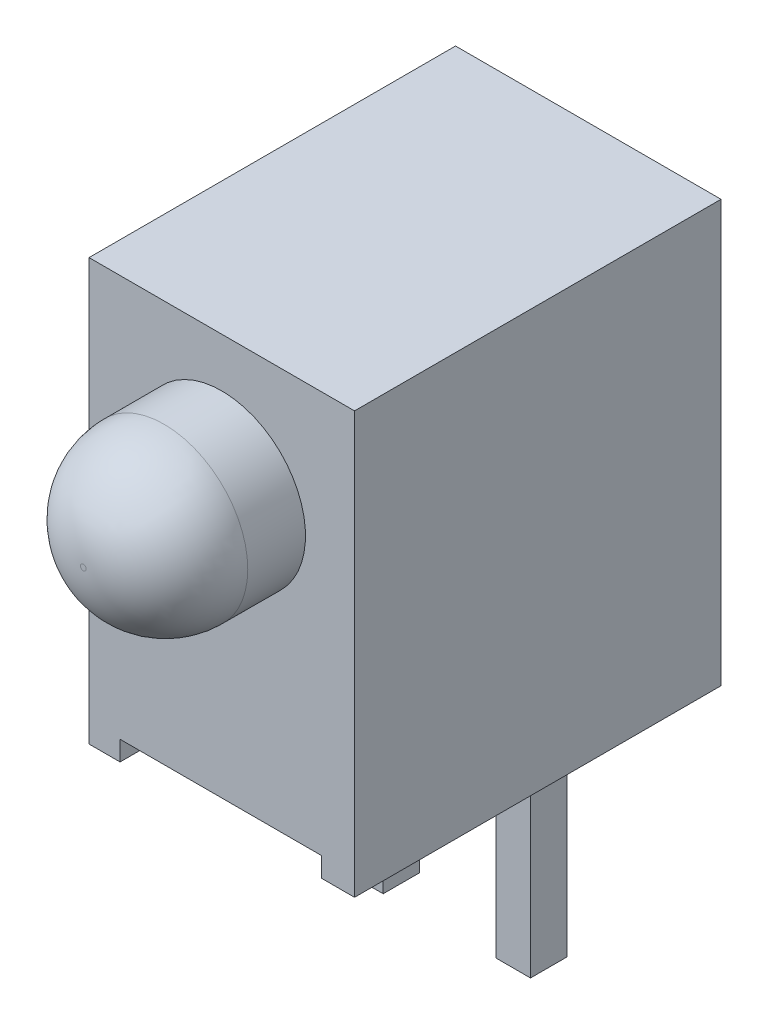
ISO-10303-21;
HEADER;
FILE_DESCRIPTION(('STEP AP214'),'2;1');
FILE_NAME('part.step','',(''),(''),'','','');
FILE_SCHEMA(('AUTOMOTIVE_DESIGN { 1 0 10303 214 1 1 1 1 }'));
ENDSEC;
DATA;
#1=APPLICATION_CONTEXT('core data for automotive mechanical design processes');
#2=APPLICATION_PROTOCOL_DEFINITION('international standard','automotive_design',2000,#1);
#3=PRODUCT_CONTEXT('',#1,'mechanical');
#4=PRODUCT('Part','Part','',(#3));
#5=PRODUCT_RELATED_PRODUCT_CATEGORY('part','',(#4));
#6=PRODUCT_DEFINITION_FORMATION('','',#4);
#7=PRODUCT_DEFINITION_CONTEXT('part definition',#1,'design');
#8=PRODUCT_DEFINITION('design','',#6,#7);
#9=PRODUCT_DEFINITION_SHAPE('','',#8);
#10=(LENGTH_UNIT() NAMED_UNIT(*) SI_UNIT(.MILLI.,.METRE.));
#11=(NAMED_UNIT(*) PLANE_ANGLE_UNIT() SI_UNIT($,.RADIAN.));
#12=(NAMED_UNIT(*) SI_UNIT($,.STERADIAN.) SOLID_ANGLE_UNIT());
#13=UNCERTAINTY_MEASURE_WITH_UNIT(LENGTH_MEASURE(1.E-05),#10,'distance_accuracy_value','');
#14=(GEOMETRIC_REPRESENTATION_CONTEXT(3) GLOBAL_UNCERTAINTY_ASSIGNED_CONTEXT((#13)) GLOBAL_UNIT_ASSIGNED_CONTEXT((#10,
#11,#12)) REPRESENTATION_CONTEXT('',''));
#15=CARTESIAN_POINT('',(0.,0.,0.));
#16=DIRECTION('',(0.,0.,1.));
#17=DIRECTION('',(1.,0.,0.));
#18=AXIS2_PLACEMENT_3D('',#15,#16,#17);
#19=CARTESIAN_POINT('',(-1.76265219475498,0.340679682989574,-3.175));
#20=DIRECTION('',(0.,1.,0.));
#21=DIRECTION('',(0.,0.,1.));
#22=AXIS2_PLACEMENT_3D('',#19,#20,#21);
#23=PLANE('',#22);
#24=DIRECTION('',(0.,0.,1.));
#25=VECTOR('',#24,1.);
#26=CARTESIAN_POINT('',(-0.974553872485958,0.340679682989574,-0.596020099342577));
#27=LINE('',#26,#25);
#28=CARTESIAN_POINT('',(-0.974553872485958,0.340679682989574,-1.22879915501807));
#29=VERTEX_POINT('',#28);
#30=CARTESIAN_POINT('',(-0.974553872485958,0.340679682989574,-0.596020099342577));
#31=VERTEX_POINT('',#30);
#32=EDGE_CURVE('E166',#29,#31,#27,.T.);
#33=ORIENTED_EDGE('',*,*,#32,.F.);
#34=DIRECTION('',(1.,0.,0.));
#35=VECTOR('',#34,1.);
#36=CARTESIAN_POINT('',(-1.57455387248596,0.340679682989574,-1.22879915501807));
#37=LINE('',#36,#35);
#38=CARTESIAN_POINT('',(-1.57455387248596,0.340679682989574,-1.22879915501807));
#39=VERTEX_POINT('',#38);
#40=EDGE_CURVE('E179',#39,#29,#37,.T.);
#41=ORIENTED_EDGE('',*,*,#40,.F.);
#42=DIRECTION('',(0.,0.,-1.));
#43=VECTOR('',#42,1.);
#44=CARTESIAN_POINT('',(-1.57455387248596,0.340679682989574,-0.596020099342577));
#45=LINE('',#44,#43);
#46=CARTESIAN_POINT('',(-1.57455387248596,0.340679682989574,-0.596020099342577));
#47=VERTEX_POINT('',#46);
#48=EDGE_CURVE('E188',#47,#39,#45,.T.);
#49=ORIENTED_EDGE('',*,*,#48,.F.);
#50=DIRECTION('',(-1.,0.,0.));
#51=VECTOR('',#50,1.);
#52=CARTESIAN_POINT('',(-1.57455387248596,0.340679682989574,-0.596020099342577));
#53=LINE('',#52,#51);
#54=EDGE_CURVE('E169',#31,#47,#53,.T.);
#55=ORIENTED_EDGE('',*,*,#54,.F.);
#56=EDGE_LOOP('',(#33,#41,#49,#55));
#57=FACE_BOUND('',#56,.T.);
#58=DIRECTION('',(-1.,0.,0.));
#59=VECTOR('',#58,1.);
#60=CARTESIAN_POINT('',(-1.76265219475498,0.340679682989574,3.175));
#61=LINE('',#60,#59);
#62=CARTESIAN_POINT('',(1.73117626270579,0.340679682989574,3.175));
#63=VERTEX_POINT('',#62);
#64=CARTESIAN_POINT('',(-1.76265219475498,0.340679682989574,3.175));
#65=VERTEX_POINT('',#64);
#66=EDGE_CURVE('E209',#63,#65,#61,.T.);
#67=ORIENTED_EDGE('',*,*,#66,.T.);
#68=DIRECTION('',(0.,0.,1.));
#69=VECTOR('',#68,1.);
#70=CARTESIAN_POINT('',(-1.76265219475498,0.340679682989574,-3.175));
#71=LINE('',#70,#69);
#72=CARTESIAN_POINT('',(-1.76265219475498,0.340679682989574,-3.175));
#73=VERTEX_POINT('',#72);
#74=EDGE_CURVE('E222',#73,#65,#71,.T.);
#75=ORIENTED_EDGE('',*,*,#74,.F.);
#76=DIRECTION('',(-1.,0.,0.));
#77=VECTOR('',#76,1.);
#78=CARTESIAN_POINT('',(-1.76265219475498,0.340679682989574,-3.175));
#79=LINE('',#78,#77);
#80=CARTESIAN_POINT('',(1.73117626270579,0.340679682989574,-3.175));
#81=VERTEX_POINT('',#80);
#82=EDGE_CURVE('E212',#81,#73,#79,.T.);
#83=ORIENTED_EDGE('',*,*,#82,.F.);
#84=DIRECTION('',(0.,0.,1.));
#85=VECTOR('',#84,1.);
#86=CARTESIAN_POINT('',(1.73117626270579,0.340679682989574,-3.175));
#87=LINE('',#86,#85);
#88=EDGE_CURVE('E225',#81,#63,#87,.T.);
#89=ORIENTED_EDGE('',*,*,#88,.T.);
#90=EDGE_LOOP('',(#67,#75,#83,#89));
#91=FACE_BOUND('',#90,.T.);
#92=DIRECTION('',(0.,0.,1.));
#93=VECTOR('',#92,1.);
#94=CARTESIAN_POINT('',(1.56544612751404,0.340679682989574,-0.608610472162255));
#95=LINE('',#94,#93);
#96=CARTESIAN_POINT('',(1.56544612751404,0.340679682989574,-1.24138952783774));
#97=VERTEX_POINT('',#96);
#98=CARTESIAN_POINT('',(1.56544612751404,0.340679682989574,-0.608610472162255));
#99=VERTEX_POINT('',#98);
#100=EDGE_CURVE('E165',#97,#99,#95,.T.);
#101=ORIENTED_EDGE('',*,*,#100,.F.);
#102=DIRECTION('',(1.,0.,0.));
#103=VECTOR('',#102,1.);
#104=CARTESIAN_POINT('',(0.965446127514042,0.340679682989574,-1.24138952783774));
#105=LINE('',#104,#103);
#106=CARTESIAN_POINT('',(0.965446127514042,0.340679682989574,-1.24138952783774));
#107=VERTEX_POINT('',#106);
#108=EDGE_CURVE('E162',#107,#97,#105,.T.);
#109=ORIENTED_EDGE('',*,*,#108,.F.);
#110=DIRECTION('',(0.,0.,-1.));
#111=VECTOR('',#110,1.);
#112=CARTESIAN_POINT('',(0.965446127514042,0.340679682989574,-0.608610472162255));
#113=LINE('',#112,#111);
#114=CARTESIAN_POINT('',(0.965446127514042,0.340679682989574,-0.608610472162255));
#115=VERTEX_POINT('',#114);
#116=EDGE_CURVE('E52',#115,#107,#113,.T.);
#117=ORIENTED_EDGE('',*,*,#116,.F.);
#118=DIRECTION('',(-1.,0.,0.));
#119=VECTOR('',#118,1.);
#120=CARTESIAN_POINT('',(0.965446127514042,0.340679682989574,-0.608610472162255));
#121=LINE('',#120,#119);
#122=EDGE_CURVE('E47',#99,#115,#121,.T.);
#123=ORIENTED_EDGE('',*,*,#122,.F.);
#124=EDGE_LOOP('',(#101,#109,#117,#123));
#125=FACE_BOUND('',#124,.T.);
#126=ADVANCED_FACE('F32',(#57,#91,#125),#23,.F.);
#127=CARTESIAN_POINT('',(2.3,0.,3.175));
#128=DIRECTION('',(0.,1.,0.));
#129=DIRECTION('',(0.,0.,1.));
#130=AXIS2_PLACEMENT_3D('',#127,#128,#129);
#131=PLANE('',#130);
#132=DIRECTION('',(-1.,0.,0.));
#133=VECTOR('',#132,1.);
#134=CARTESIAN_POINT('',(-2.3,0.,-3.175));
#135=LINE('',#134,#133);
#136=CARTESIAN_POINT('',(-1.76265219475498,0.,-3.175));
#137=VERTEX_POINT('',#136);
#138=CARTESIAN_POINT('',(-2.3,0.,-3.175));
#139=VERTEX_POINT('',#138);
#140=EDGE_CURVE('E244',#137,#139,#135,.T.);
#141=ORIENTED_EDGE('',*,*,#140,.F.);
#142=DIRECTION('',(0.,0.,1.));
#143=VECTOR('',#142,1.);
#144=CARTESIAN_POINT('',(-1.76265219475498,0.,-3.175));
#145=LINE('',#144,#143);
#146=CARTESIAN_POINT('',(-1.76265219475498,0.,3.175));
#147=VERTEX_POINT('',#146);
#148=EDGE_CURVE('E215',#137,#147,#145,.T.);
#149=ORIENTED_EDGE('',*,*,#148,.T.);
#150=DIRECTION('',(1.,0.,0.));
#151=VECTOR('',#150,1.);
#152=CARTESIAN_POINT('',(-2.3,0.,3.175));
#153=LINE('',#152,#151);
#154=CARTESIAN_POINT('',(-2.3,0.,3.175));
#155=VERTEX_POINT('',#154);
#156=EDGE_CURVE('E235',#155,#147,#153,.T.);
#157=ORIENTED_EDGE('',*,*,#156,.F.);
#158=DIRECTION('',(0.,0.,1.));
#159=VECTOR('',#158,1.);
#160=CARTESIAN_POINT('',(-2.3,0.,-3.175));
#161=LINE('',#160,#159);
#162=EDGE_CURVE('E248',#139,#155,#161,.T.);
#163=ORIENTED_EDGE('',*,*,#162,.F.);
#164=EDGE_LOOP('',(#141,#149,#157,#163));
#165=FACE_BOUND('',#164,.T.);
#166=ADVANCED_FACE('F285',(#165),#131,.F.);
#167=CARTESIAN_POINT('',(-2.3,7.3,3.175));
#168=DIRECTION('',(0.,0.,-1.));
#169=DIRECTION('',(-1.,0.,0.));
#170=AXIS2_PLACEMENT_3D('',#167,#168,#169);
#171=PLANE('',#170);
#172=ORIENTED_EDGE('',*,*,#156,.T.);
#173=DIRECTION('',(0.,-1.,0.));
#174=VECTOR('',#173,1.);
#175=CARTESIAN_POINT('',(-1.76265219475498,0.,3.175));
#176=LINE('',#175,#174);
#177=EDGE_CURVE('E204',#65,#147,#176,.T.);
#178=ORIENTED_EDGE('',*,*,#177,.F.);
#179=ORIENTED_EDGE('',*,*,#66,.F.);
#180=DIRECTION('',(0.,1.,0.));
#181=VECTOR('',#180,1.);
#182=CARTESIAN_POINT('',(1.73117626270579,0.,3.175));
#183=LINE('',#182,#181);
#184=CARTESIAN_POINT('',(1.73117626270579,0.,3.175));
#185=VERTEX_POINT('',#184);
#186=EDGE_CURVE('E217',#185,#63,#183,.T.);
#187=ORIENTED_EDGE('',*,*,#186,.F.);
#188=CARTESIAN_POINT('',(2.3,0.,3.175));
#189=VERTEX_POINT('',#188);
#190=EDGE_CURVE('E250',#185,#189,#153,.T.);
#191=ORIENTED_EDGE('',*,*,#190,.T.);
#192=DIRECTION('',(0.,-1.,0.));
#193=VECTOR('',#192,1.);
#194=CARTESIAN_POINT('',(2.3,7.3,3.175));
#195=LINE('',#194,#193);
#196=CARTESIAN_POINT('',(2.3,7.3,3.175));
#197=VERTEX_POINT('',#196);
#198=EDGE_CURVE('E241',#197,#189,#195,.T.);
#199=ORIENTED_EDGE('',*,*,#198,.F.);
#200=DIRECTION('',(1.,0.,0.));
#201=VECTOR('',#200,1.);
#202=CARTESIAN_POINT('',(-2.3,7.3,3.175));
#203=LINE('',#202,#201);
#204=CARTESIAN_POINT('',(-2.3,7.3,3.175));
#205=VERTEX_POINT('',#204);
#206=EDGE_CURVE('E239',#205,#197,#203,.T.);
#207=ORIENTED_EDGE('',*,*,#206,.F.);
#208=DIRECTION('',(0.,-1.,0.));
#209=VECTOR('',#208,1.);
#210=CARTESIAN_POINT('',(-2.3,7.3,3.175));
#211=LINE('',#210,#209);
#212=EDGE_CURVE('E255',#205,#155,#211,.T.);
#213=ORIENTED_EDGE('',*,*,#212,.T.);
#214=EDGE_LOOP('',(#172,#178,#179,#187,#191,#199,#207,#213));
#215=FACE_BOUND('',#214,.T.);
#216=CARTESIAN_POINT('',(0.,5.,3.175));
#217=DIRECTION('',(0.,0.,-1.));
#218=DIRECTION('',(-1.,0.,0.));
#219=AXIS2_PLACEMENT_3D('',#216,#217,#218);
#220=CIRCLE('',#219,1.45);
#221=CARTESIAN_POINT('',(-1.45,5.,3.175));
#222=VERTEX_POINT('',#221);
#223=EDGE_CURVE('E264',#222,#222,#220,.F.);
#224=ORIENTED_EDGE('',*,*,#223,.F.);
#225=EDGE_LOOP('',(#224));
#226=FACE_BOUND('',#225,.T.);
#227=ADVANCED_FACE('F291',(#215,#226),#171,.F.);
#228=CARTESIAN_POINT('',(2.3,7.3,-3.175));
#229=DIRECTION('',(-1.,0.,0.));
#230=DIRECTION('',(0.,0.,1.));
#231=AXIS2_PLACEMENT_3D('',#228,#229,#230);
#232=PLANE('',#231);
#233=DIRECTION('',(0.,0.,-1.));
#234=VECTOR('',#233,1.);
#235=CARTESIAN_POINT('',(2.3,0.,-3.175));
#236=LINE('',#235,#234);
#237=CARTESIAN_POINT('',(2.3,0.,-3.175));
#238=VERTEX_POINT('',#237);
#239=EDGE_CURVE('E224',#189,#238,#236,.T.);
#240=ORIENTED_EDGE('',*,*,#239,.T.);
#241=DIRECTION('',(0.,-1.,0.));
#242=VECTOR('',#241,1.);
#243=CARTESIAN_POINT('',(2.3,7.3,-3.175));
#244=LINE('',#243,#242);
#245=CARTESIAN_POINT('',(2.3,7.3,-3.175));
#246=VERTEX_POINT('',#245);
#247=EDGE_CURVE('E261',#246,#238,#244,.T.);
#248=ORIENTED_EDGE('',*,*,#247,.F.);
#249=DIRECTION('',(0.,0.,-1.));
#250=VECTOR('',#249,1.);
#251=CARTESIAN_POINT('',(2.3,7.3,-3.175));
#252=LINE('',#251,#250);
#253=EDGE_CURVE('E231',#197,#246,#252,.T.);
#254=ORIENTED_EDGE('',*,*,#253,.F.);
#255=ORIENTED_EDGE('',*,*,#198,.T.);
#256=EDGE_LOOP('',(#240,#248,#254,#255));
#257=FACE_BOUND('',#256,.T.);
#258=ADVANCED_FACE('F315',(#257),#232,.F.);
#259=CARTESIAN_POINT('',(-2.3,7.3,-3.175));
#260=DIRECTION('',(0.,0.,1.));
#261=DIRECTION('',(1.,0.,0.));
#262=AXIS2_PLACEMENT_3D('',#259,#260,#261);
#263=PLANE('',#262);
#264=ORIENTED_EDGE('',*,*,#82,.T.);
#265=DIRECTION('',(0.,-1.,0.));
#266=VECTOR('',#265,1.);
#267=CARTESIAN_POINT('',(-1.76265219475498,0.,-3.175));
#268=LINE('',#267,#266);
#269=EDGE_CURVE('E205',#73,#137,#268,.T.);
#270=ORIENTED_EDGE('',*,*,#269,.T.);
#271=ORIENTED_EDGE('',*,*,#140,.T.);
#272=DIRECTION('',(0.,-1.,0.));
#273=VECTOR('',#272,1.);
#274=CARTESIAN_POINT('',(-2.3,7.3,-3.175));
#275=LINE('',#274,#273);
#276=CARTESIAN_POINT('',(-2.3,7.3,-3.175));
#277=VERTEX_POINT('',#276);
#278=EDGE_CURVE('E258',#277,#139,#275,.T.);
#279=ORIENTED_EDGE('',*,*,#278,.F.);
#280=DIRECTION('',(-1.,0.,0.));
#281=VECTOR('',#280,1.);
#282=CARTESIAN_POINT('',(-2.3,7.3,-3.175));
#283=LINE('',#282,#281);
#284=EDGE_CURVE('E234',#246,#277,#283,.T.);
#285=ORIENTED_EDGE('',*,*,#284,.F.);
#286=ORIENTED_EDGE('',*,*,#247,.T.);
#287=CARTESIAN_POINT('',(1.73117626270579,0.,-3.175));
#288=VERTEX_POINT('',#287);
#289=EDGE_CURVE('E245',#238,#288,#135,.T.);
#290=ORIENTED_EDGE('',*,*,#289,.T.);
#291=DIRECTION('',(0.,1.,0.));
#292=VECTOR('',#291,1.);
#293=CARTESIAN_POINT('',(1.73117626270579,0.,-3.175));
#294=LINE('',#293,#292);
#295=EDGE_CURVE('E208',#288,#81,#294,.T.);
#296=ORIENTED_EDGE('',*,*,#295,.T.);
#297=EDGE_LOOP('',(#264,#270,#271,#279,#285,#286,#290,#296));
#298=FACE_BOUND('',#297,.T.);
#299=ADVANCED_FACE('F319',(#298),#263,.F.);
#300=CARTESIAN_POINT('',(-2.3,7.3,-3.175));
#301=DIRECTION('',(1.,0.,0.));
#302=DIRECTION('',(0.,0.,-1.));
#303=AXIS2_PLACEMENT_3D('',#300,#301,#302);
#304=PLANE('',#303);
#305=ORIENTED_EDGE('',*,*,#162,.T.);
#306=ORIENTED_EDGE('',*,*,#212,.F.);
#307=DIRECTION('',(0.,0.,1.));
#308=VECTOR('',#307,1.);
#309=CARTESIAN_POINT('',(-2.3,7.3,-3.175));
#310=LINE('',#309,#308);
#311=EDGE_CURVE('E237',#277,#205,#310,.T.);
#312=ORIENTED_EDGE('',*,*,#311,.F.);
#313=ORIENTED_EDGE('',*,*,#278,.T.);
#314=EDGE_LOOP('',(#305,#306,#312,#313));
#315=FACE_BOUND('',#314,.T.);
#316=ADVANCED_FACE('F308',(#315),#304,.F.);
#317=CARTESIAN_POINT('',(2.3,7.3,3.175));
#318=DIRECTION('',(0.,1.,0.));
#319=DIRECTION('',(0.,0.,1.));
#320=AXIS2_PLACEMENT_3D('',#317,#318,#319);
#321=PLANE('',#320);
#322=ORIENTED_EDGE('',*,*,#253,.T.);
#323=ORIENTED_EDGE('',*,*,#284,.T.);
#324=ORIENTED_EDGE('',*,*,#311,.T.);
#325=ORIENTED_EDGE('',*,*,#206,.T.);
#326=EDGE_LOOP('',(#322,#323,#324,#325));
#327=FACE_BOUND('',#326,.T.);
#328=ADVANCED_FACE('F306',(#327),#321,.T.);
#329=ORIENTED_EDGE('',*,*,#190,.F.);
#330=DIRECTION('',(0.,0.,1.));
#331=VECTOR('',#330,1.);
#332=CARTESIAN_POINT('',(1.73117626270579,0.,-3.175));
#333=LINE('',#332,#331);
#334=EDGE_CURVE('E227',#288,#185,#333,.T.);
#335=ORIENTED_EDGE('',*,*,#334,.F.);
#336=ORIENTED_EDGE('',*,*,#289,.F.);
#337=ORIENTED_EDGE('',*,*,#239,.F.);
#338=EDGE_LOOP('',(#329,#335,#336,#337));
#339=FACE_BOUND('',#338,.T.);
#340=ADVANCED_FACE('F294',(#339),#131,.F.);
#341=CARTESIAN_POINT('',(0.,5.,5.575));
#342=DIRECTION('',(0.,0.,-1.));
#343=DIRECTION('',(-1.,0.,0.));
#344=AXIS2_PLACEMENT_3D('',#341,#342,#343);
#345=CYLINDRICAL_SURFACE('',#344,1.45);
#346=CARTESIAN_POINT('',(0.,5.,4.175));
#347=DIRECTION('',(0.,0.,1.));
#348=DIRECTION('',(1.,0.,0.));
#349=AXIS2_PLACEMENT_3D('',#346,#347,#348);
#350=CIRCLE('',#349,1.45);
#351=CARTESIAN_POINT('',(1.45,5.,4.175));
#352=VERTEX_POINT('',#351);
#353=EDGE_CURVE('E11',#352,#352,#350,.F.);
#354=ORIENTED_EDGE('',*,*,#353,.T.);
#355=EDGE_LOOP('',(#354));
#356=FACE_BOUND('',#355,.T.);
#357=ORIENTED_EDGE('',*,*,#223,.T.);
#358=EDGE_LOOP('',(#357));
#359=FACE_BOUND('',#358,.T.);
#360=ADVANCED_FACE('F281',(#356,#359),#345,.T.);
#361=CARTESIAN_POINT('',(0.,5.,5.575));
#362=DIRECTION('',(0.,0.,1.));
#363=DIRECTION('',(1.,0.,0.));
#364=AXIS2_PLACEMENT_3D('',#361,#362,#363);
#365=PLANE('',#364);
#366=CARTESIAN_POINT('',(0.,5.,5.575));
#367=DIRECTION('',(0.,0.,1.));
#368=DIRECTION('',(1.,0.,0.));
#369=AXIS2_PLACEMENT_3D('',#366,#367,#368);
#370=CIRCLE('',#369,0.0499999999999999);
#371=CARTESIAN_POINT('',(0.0499999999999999,5.,5.575));
#372=VERTEX_POINT('',#371);
#373=EDGE_CURVE('E40',#372,#372,#370,.T.);
#374=ORIENTED_EDGE('',*,*,#373,.T.);
#375=EDGE_LOOP('',(#374));
#376=FACE_BOUND('',#375,.T.);
#377=ADVANCED_FACE('F269',(#376),#365,.T.);
#378=CARTESIAN_POINT('',(0.,5.,4.175));
#379=DIRECTION('',(0.,0.,1.));
#380=DIRECTION('',(1.,0.,0.));
#381=AXIS2_PLACEMENT_3D('',#378,#379,#380);
#382=DEGENERATE_TOROIDAL_SURFACE('',#381,0.0499999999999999,1.4,.T.);
#383=ORIENTED_EDGE('',*,*,#353,.F.);
#384=EDGE_LOOP('',(#383));
#385=FACE_BOUND('',#384,.T.);
#386=ORIENTED_EDGE('',*,*,#373,.F.);
#387=EDGE_LOOP('',(#386));
#388=FACE_BOUND('',#387,.T.);
#389=ADVANCED_FACE('F34',(#385,#388),#382,.T.);
#390=CARTESIAN_POINT('',(-1.76265219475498,0.,-3.175));
#391=DIRECTION('',(-1.,0.,0.));
#392=DIRECTION('',(0.,0.,1.));
#393=AXIS2_PLACEMENT_3D('',#390,#391,#392);
#394=PLANE('',#393);
#395=ORIENTED_EDGE('',*,*,#177,.T.);
#396=ORIENTED_EDGE('',*,*,#148,.F.);
#397=ORIENTED_EDGE('',*,*,#269,.F.);
#398=ORIENTED_EDGE('',*,*,#74,.T.);
#399=EDGE_LOOP('',(#395,#396,#397,#398));
#400=FACE_BOUND('',#399,.T.);
#401=ADVANCED_FACE('F272',(#400),#394,.F.);
#402=CARTESIAN_POINT('',(1.73117626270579,0.,-3.175));
#403=DIRECTION('',(1.,0.,0.));
#404=DIRECTION('',(0.,0.,-1.));
#405=AXIS2_PLACEMENT_3D('',#402,#403,#404);
#406=PLANE('',#405);
#407=ORIENTED_EDGE('',*,*,#186,.T.);
#408=ORIENTED_EDGE('',*,*,#88,.F.);
#409=ORIENTED_EDGE('',*,*,#295,.F.);
#410=ORIENTED_EDGE('',*,*,#334,.T.);
#411=EDGE_LOOP('',(#407,#408,#409,#410));
#412=FACE_BOUND('',#411,.T.);
#413=ADVANCED_FACE('F278',(#412),#406,.F.);
#414=CARTESIAN_POINT('',(-0.974553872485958,-3.46932031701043,-0.596020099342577));
#415=DIRECTION('',(-1.,0.,0.));
#416=DIRECTION('',(0.,0.,1.));
#417=AXIS2_PLACEMENT_3D('',#414,#415,#416);
#418=PLANE('',#417);
#419=ORIENTED_EDGE('',*,*,#32,.T.);
#420=DIRECTION('',(0.,1.,0.));
#421=VECTOR('',#420,1.);
#422=CARTESIAN_POINT('',(-0.974553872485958,-3.46932031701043,-0.596020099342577));
#423=LINE('',#422,#421);
#424=CARTESIAN_POINT('',(-0.974553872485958,-3.46932031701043,-0.596020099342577));
#425=VERTEX_POINT('',#424);
#426=EDGE_CURVE('E201',#425,#31,#423,.T.);
#427=ORIENTED_EDGE('',*,*,#426,.F.);
#428=DIRECTION('',(0.,0.,1.));
#429=VECTOR('',#428,1.);
#430=CARTESIAN_POINT('',(-0.974553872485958,-3.46932031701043,-0.596020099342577));
#431=LINE('',#430,#429);
#432=CARTESIAN_POINT('',(-0.974553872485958,-3.46932031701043,-1.22879915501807));
#433=VERTEX_POINT('',#432);
#434=EDGE_CURVE('E175',#433,#425,#431,.T.);
#435=ORIENTED_EDGE('',*,*,#434,.F.);
#436=DIRECTION('',(0.,1.,0.));
#437=VECTOR('',#436,1.);
#438=CARTESIAN_POINT('',(-0.974553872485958,-3.46932031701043,-1.22879915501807));
#439=LINE('',#438,#437);
#440=EDGE_CURVE('E184',#433,#29,#439,.T.);
#441=ORIENTED_EDGE('',*,*,#440,.T.);
#442=EDGE_LOOP('',(#419,#427,#435,#441));
#443=FACE_BOUND('',#442,.T.);
#444=ADVANCED_FACE('F298',(#443),#418,.F.);
#445=CARTESIAN_POINT('',(-1.57455387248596,-3.46932031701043,-0.596020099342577));
#446=DIRECTION('',(0.,0.,-1.));
#447=DIRECTION('',(-1.,0.,0.));
#448=AXIS2_PLACEMENT_3D('',#445,#446,#447);
#449=PLANE('',#448);
#450=ORIENTED_EDGE('',*,*,#54,.T.);
#451=DIRECTION('',(0.,1.,0.));
#452=VECTOR('',#451,1.);
#453=CARTESIAN_POINT('',(-1.57455387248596,-3.46932031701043,-0.596020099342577));
#454=LINE('',#453,#452);
#455=CARTESIAN_POINT('',(-1.57455387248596,-3.46932031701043,-0.596020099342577));
#456=VERTEX_POINT('',#455);
#457=EDGE_CURVE('E198',#456,#47,#454,.T.);
#458=ORIENTED_EDGE('',*,*,#457,.F.);
#459=DIRECTION('',(-1.,0.,0.));
#460=VECTOR('',#459,1.);
#461=CARTESIAN_POINT('',(-1.57455387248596,-3.46932031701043,-0.596020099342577));
#462=LINE('',#461,#460);
#463=EDGE_CURVE('E178',#425,#456,#462,.T.);
#464=ORIENTED_EDGE('',*,*,#463,.F.);
#465=ORIENTED_EDGE('',*,*,#426,.T.);
#466=EDGE_LOOP('',(#450,#458,#464,#465));
#467=FACE_BOUND('',#466,.T.);
#468=ADVANCED_FACE('F383',(#467),#449,.F.);
#469=CARTESIAN_POINT('',(-1.57455387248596,-3.46932031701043,-0.596020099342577));
#470=DIRECTION('',(1.,0.,0.));
#471=DIRECTION('',(0.,0.,-1.));
#472=AXIS2_PLACEMENT_3D('',#469,#470,#471);
#473=PLANE('',#472);
#474=ORIENTED_EDGE('',*,*,#48,.T.);
#475=DIRECTION('',(0.,1.,0.));
#476=VECTOR('',#475,1.);
#477=CARTESIAN_POINT('',(-1.57455387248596,-3.46932031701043,-1.22879915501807));
#478=LINE('',#477,#476);
#479=CARTESIAN_POINT('',(-1.57455387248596,-3.46932031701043,-1.22879915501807));
#480=VERTEX_POINT('',#479);
#481=EDGE_CURVE('E195',#480,#39,#478,.T.);
#482=ORIENTED_EDGE('',*,*,#481,.F.);
#483=DIRECTION('',(0.,0.,-1.));
#484=VECTOR('',#483,1.);
#485=CARTESIAN_POINT('',(-1.57455387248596,-3.46932031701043,-0.596020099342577));
#486=LINE('',#485,#484);
#487=EDGE_CURVE('E181',#456,#480,#486,.T.);
#488=ORIENTED_EDGE('',*,*,#487,.F.);
#489=ORIENTED_EDGE('',*,*,#457,.T.);
#490=EDGE_LOOP('',(#474,#482,#488,#489));
#491=FACE_BOUND('',#490,.T.);
#492=ADVANCED_FACE('F380',(#491),#473,.F.);
#493=CARTESIAN_POINT('',(-1.57455387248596,-3.46932031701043,-1.22879915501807));
#494=DIRECTION('',(0.,0.,1.));
#495=DIRECTION('',(1.,0.,0.));
#496=AXIS2_PLACEMENT_3D('',#493,#494,#495);
#497=PLANE('',#496);
#498=ORIENTED_EDGE('',*,*,#40,.T.);
#499=ORIENTED_EDGE('',*,*,#440,.F.);
#500=DIRECTION('',(1.,0.,0.));
#501=VECTOR('',#500,1.);
#502=CARTESIAN_POINT('',(-1.57455387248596,-3.46932031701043,-1.22879915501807));
#503=LINE('',#502,#501);
#504=EDGE_CURVE('E183',#480,#433,#503,.T.);
#505=ORIENTED_EDGE('',*,*,#504,.F.);
#506=ORIENTED_EDGE('',*,*,#481,.T.);
#507=EDGE_LOOP('',(#498,#499,#505,#506));
#508=FACE_BOUND('',#507,.T.);
#509=ADVANCED_FACE('F376',(#508),#497,.F.);
#510=CARTESIAN_POINT('',(-0.974553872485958,-3.46932031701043,-1.22879915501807));
#511=DIRECTION('',(0.,-1.,0.));
#512=DIRECTION('',(0.,0.,-1.));
#513=AXIS2_PLACEMENT_3D('',#510,#511,#512);
#514=PLANE('',#513);
#515=ORIENTED_EDGE('',*,*,#434,.T.);
#516=ORIENTED_EDGE('',*,*,#463,.T.);
#517=ORIENTED_EDGE('',*,*,#487,.T.);
#518=ORIENTED_EDGE('',*,*,#504,.T.);
#519=EDGE_LOOP('',(#515,#516,#517,#518));
#520=FACE_BOUND('',#519,.T.);
#521=ADVANCED_FACE('F373',(#520),#514,.T.);
#522=CARTESIAN_POINT('',(1.56544612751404,-3.46932031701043,-0.608610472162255));
#523=DIRECTION('',(-1.,0.,0.));
#524=DIRECTION('',(0.,0.,1.));
#525=AXIS2_PLACEMENT_3D('',#522,#523,#524);
#526=PLANE('',#525);
#527=ORIENTED_EDGE('',*,*,#100,.T.);
#528=DIRECTION('',(0.,1.,0.));
#529=VECTOR('',#528,1.);
#530=CARTESIAN_POINT('',(1.56544612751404,-3.46932031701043,-0.608610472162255));
#531=LINE('',#530,#529);
#532=CARTESIAN_POINT('',(1.56544612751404,-3.46932031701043,-0.608610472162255));
#533=VERTEX_POINT('',#532);
#534=EDGE_CURVE('E146',#533,#99,#531,.T.);
#535=ORIENTED_EDGE('',*,*,#534,.F.);
#536=DIRECTION('',(0.,0.,1.));
#537=VECTOR('',#536,1.);
#538=CARTESIAN_POINT('',(1.56544612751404,-3.46932031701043,-0.608610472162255));
#539=LINE('',#538,#537);
#540=CARTESIAN_POINT('',(1.56544612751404,-3.46932031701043,-1.24138952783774));
#541=VERTEX_POINT('',#540);
#542=EDGE_CURVE('E153',#541,#533,#539,.T.);
#543=ORIENTED_EDGE('',*,*,#542,.F.);
#544=DIRECTION('',(0.,1.,0.));
#545=VECTOR('',#544,1.);
#546=CARTESIAN_POINT('',(1.56544612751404,-3.46932031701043,-1.24138952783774));
#547=LINE('',#546,#545);
#548=EDGE_CURVE('E351',#541,#97,#547,.T.);
#549=ORIENTED_EDGE('',*,*,#548,.T.);
#550=EDGE_LOOP('',(#527,#535,#543,#549));
#551=FACE_BOUND('',#550,.T.);
#552=ADVANCED_FACE('F164',(#551),#526,.F.);
#553=CARTESIAN_POINT('',(0.965446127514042,-3.46932031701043,-0.608610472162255));
#554=DIRECTION('',(0.,0.,-1.));
#555=DIRECTION('',(-1.,0.,0.));
#556=AXIS2_PLACEMENT_3D('',#553,#554,#555);
#557=PLANE('',#556);
#558=ORIENTED_EDGE('',*,*,#122,.T.);
#559=DIRECTION('',(0.,1.,0.));
#560=VECTOR('',#559,1.);
#561=CARTESIAN_POINT('',(0.965446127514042,-3.46932031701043,-0.608610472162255));
#562=LINE('',#561,#560);
#563=CARTESIAN_POINT('',(0.965446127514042,-3.46932031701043,-0.608610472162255));
#564=VERTEX_POINT('',#563);
#565=EDGE_CURVE('E149',#564,#115,#562,.T.);
#566=ORIENTED_EDGE('',*,*,#565,.F.);
#567=DIRECTION('',(-1.,0.,0.));
#568=VECTOR('',#567,1.);
#569=CARTESIAN_POINT('',(0.965446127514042,-3.46932031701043,-0.608610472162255));
#570=LINE('',#569,#568);
#571=EDGE_CURVE('E142',#533,#564,#570,.T.);
#572=ORIENTED_EDGE('',*,*,#571,.F.);
#573=ORIENTED_EDGE('',*,*,#534,.T.);
#574=EDGE_LOOP('',(#558,#566,#572,#573));
#575=FACE_BOUND('',#574,.T.);
#576=ADVANCED_FACE('F144',(#575),#557,.F.);
#577=CARTESIAN_POINT('',(0.965446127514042,-3.46932031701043,-0.608610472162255));
#578=DIRECTION('',(1.,0.,0.));
#579=DIRECTION('',(0.,0.,-1.));
#580=AXIS2_PLACEMENT_3D('',#577,#578,#579);
#581=PLANE('',#580);
#582=ORIENTED_EDGE('',*,*,#116,.T.);
#583=DIRECTION('',(0.,1.,0.));
#584=VECTOR('',#583,1.);
#585=CARTESIAN_POINT('',(0.965446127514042,-3.46932031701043,-1.24138952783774));
#586=LINE('',#585,#584);
#587=CARTESIAN_POINT('',(0.965446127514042,-3.46932031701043,-1.24138952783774));
#588=VERTEX_POINT('',#587);
#589=EDGE_CURVE('E171',#588,#107,#586,.T.);
#590=ORIENTED_EDGE('',*,*,#589,.F.);
#591=DIRECTION('',(0.,0.,-1.));
#592=VECTOR('',#591,1.);
#593=CARTESIAN_POINT('',(0.965446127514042,-3.46932031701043,-0.608610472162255));
#594=LINE('',#593,#592);
#595=EDGE_CURVE('E152',#564,#588,#594,.T.);
#596=ORIENTED_EDGE('',*,*,#595,.F.);
#597=ORIENTED_EDGE('',*,*,#565,.T.);
#598=EDGE_LOOP('',(#582,#590,#596,#597));
#599=FACE_BOUND('',#598,.T.);
#600=ADVANCED_FACE('F360',(#599),#581,.F.);
#601=CARTESIAN_POINT('',(0.965446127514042,-3.46932031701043,-1.24138952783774));
#602=DIRECTION('',(0.,0.,1.));
#603=DIRECTION('',(1.,0.,0.));
#604=AXIS2_PLACEMENT_3D('',#601,#602,#603);
#605=PLANE('',#604);
#606=ORIENTED_EDGE('',*,*,#108,.T.);
#607=ORIENTED_EDGE('',*,*,#548,.F.);
#608=DIRECTION('',(1.,0.,0.));
#609=VECTOR('',#608,1.);
#610=CARTESIAN_POINT('',(0.965446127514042,-3.46932031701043,-1.24138952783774));
#611=LINE('',#610,#609);
#612=EDGE_CURVE('E158',#588,#541,#611,.T.);
#613=ORIENTED_EDGE('',*,*,#612,.F.);
#614=ORIENTED_EDGE('',*,*,#589,.T.);
#615=EDGE_LOOP('',(#606,#607,#613,#614));
#616=FACE_BOUND('',#615,.T.);
#617=ADVANCED_FACE('F350',(#616),#605,.F.);
#618=CARTESIAN_POINT('',(1.56544612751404,-3.46932031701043,-1.24138952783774));
#619=DIRECTION('',(0.,-1.,0.));
#620=DIRECTION('',(0.,0.,-1.));
#621=AXIS2_PLACEMENT_3D('',#618,#619,#620);
#622=PLANE('',#621);
#623=ORIENTED_EDGE('',*,*,#542,.T.);
#624=ORIENTED_EDGE('',*,*,#571,.T.);
#625=ORIENTED_EDGE('',*,*,#595,.T.);
#626=ORIENTED_EDGE('',*,*,#612,.T.);
#627=EDGE_LOOP('',(#623,#624,#625,#626));
#628=FACE_BOUND('',#627,.T.);
#629=ADVANCED_FACE('F156',(#628),#622,.T.);
#630=CLOSED_SHELL('',(#126,#166,#227,#258,#299,#316,#328,#340,#360,#377,#389,#401,#413,#444,
#468,#492,#509,#521,#552,#576,#600,#617,#629));
#631=MANIFOLD_SOLID_BREP('B2',#630);
#632=ADVANCED_BREP_SHAPE_REPRESENTATION('',(#18,#631),#14);
#633=SHAPE_DEFINITION_REPRESENTATION(#9,#632);
ENDSEC;
END-ISO-10303-21;
